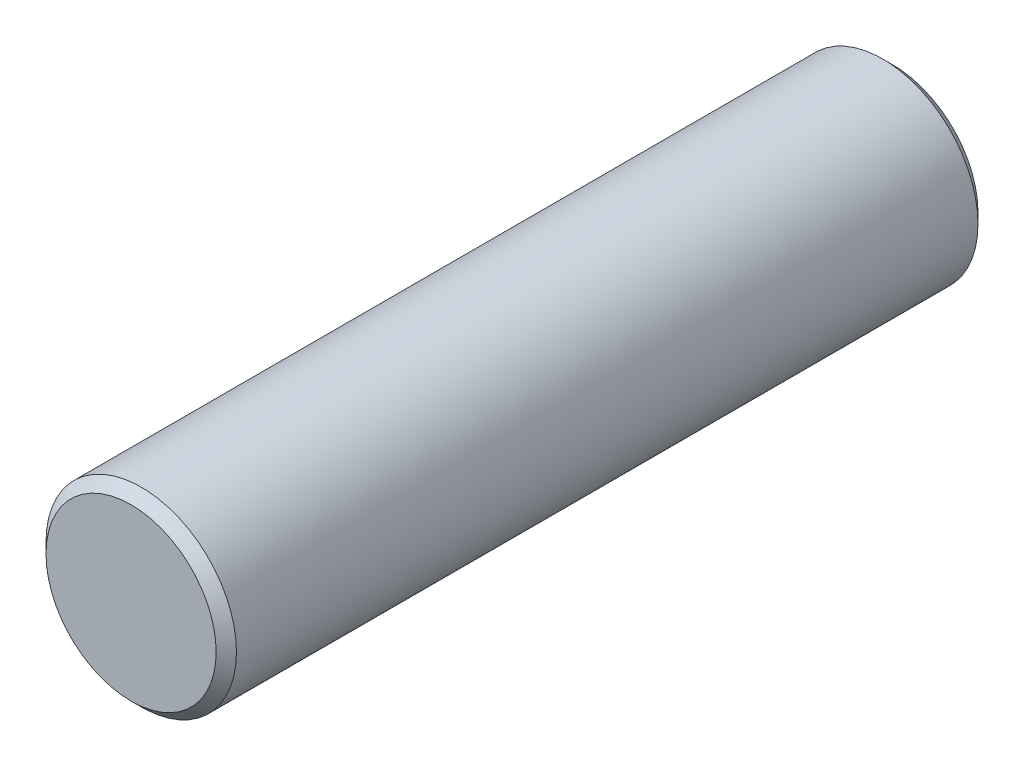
from build123d import *

# Parameters (mm, degrees)
SKETCH1_R      = 1.190625
EXTRUDE1_DEPTH = 9.525
CHAMFER1_SIZE  = 0.127


with BuildPart() as part:
    # Sketch1 → Extrude1 (new body)
    with BuildSketch(Plane.XY):
        with Locations(Location((0, 0, 0), (0, 0, 180))):
            Circle(SKETCH1_R)
    extrude(amount=EXTRUDE1_DEPTH)

    # Chamfer1
    chamfer1_edges = [part.edges().sort_by_distance(p)[0] for p in [
        (1.190625, 0, 0),
        (1.190625, 0, 9.525),
    ]]
    chamfer(chamfer1_edges, length=CHAMFER1_SIZE)


solid = part.part
